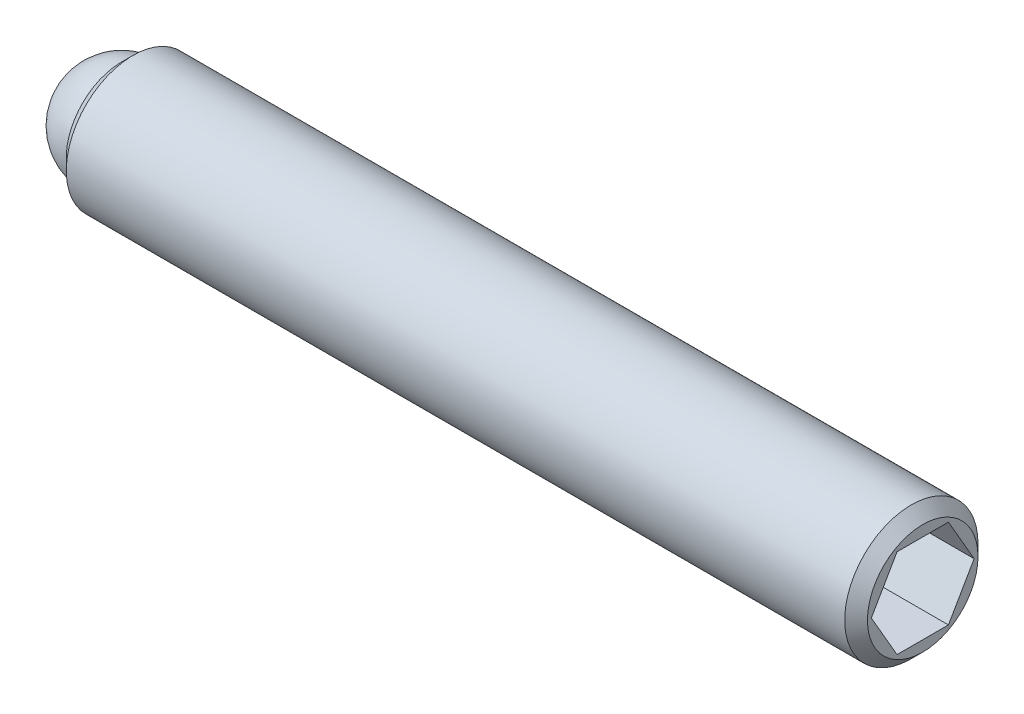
ISO-10303-21;
HEADER;
FILE_DESCRIPTION(('STEP AP214'),'2;1');
FILE_NAME('part.step','',(''),(''),'','','');
FILE_SCHEMA(('AUTOMOTIVE_DESIGN { 1 0 10303 214 1 1 1 1 }'));
ENDSEC;
DATA;
#1=APPLICATION_CONTEXT('core data for automotive mechanical design processes');
#2=APPLICATION_PROTOCOL_DEFINITION('international standard','automotive_design',2000,#1);
#3=PRODUCT_CONTEXT('',#1,'mechanical');
#4=PRODUCT('Part','Part','',(#3));
#5=PRODUCT_RELATED_PRODUCT_CATEGORY('part','',(#4));
#6=PRODUCT_DEFINITION_FORMATION('','',#4);
#7=PRODUCT_DEFINITION_CONTEXT('part definition',#1,'design');
#8=PRODUCT_DEFINITION('design','',#6,#7);
#9=PRODUCT_DEFINITION_SHAPE('','',#8);
#10=(LENGTH_UNIT() NAMED_UNIT(*) SI_UNIT(.MILLI.,.METRE.));
#11=(NAMED_UNIT(*) PLANE_ANGLE_UNIT() SI_UNIT($,.RADIAN.));
#12=(NAMED_UNIT(*) SI_UNIT($,.STERADIAN.) SOLID_ANGLE_UNIT());
#13=UNCERTAINTY_MEASURE_WITH_UNIT(LENGTH_MEASURE(1.E-05),#10,'distance_accuracy_value','');
#14=(GEOMETRIC_REPRESENTATION_CONTEXT(3) GLOBAL_UNCERTAINTY_ASSIGNED_CONTEXT((#13)) GLOBAL_UNIT_ASSIGNED_CONTEXT((#10,
#11,#12)) REPRESENTATION_CONTEXT('',''));
#15=CARTESIAN_POINT('',(0.,0.,0.));
#16=DIRECTION('',(0.,0.,1.));
#17=DIRECTION('',(1.,0.,0.));
#18=AXIS2_PLACEMENT_3D('',#15,#16,#17);
#19=CARTESIAN_POINT('',(0.,0.,0.));
#20=DIRECTION('',(0.,-1.,0.));
#21=DIRECTION('',(0.,0.,-1.));
#22=AXIS2_PLACEMENT_3D('',#19,#20,#21);
#23=SPHERICAL_SURFACE('',#22,1.190625);
#24=CARTESIAN_POINT('',(0.,-1.190625,0.));
#25=VERTEX_POINT('',#24);
#26=VERTEX_LOOP('',#25);
#27=FACE_BOUND('',#26,.T.);
#28=ADVANCED_FACE('F43',(#27),#23,.T.);
#29=CLOSED_SHELL('',(#28));
#30=MANIFOLD_SOLID_BREP('B2',#29);
#31=CARTESIAN_POINT('',(17.859375,0.,0.));
#32=DIRECTION('',(-1.,0.,0.));
#33=DIRECTION('',(0.,0.,1.));
#34=AXIS2_PLACEMENT_3D('',#31,#32,#33);
#35=CYLINDRICAL_SURFACE('',#34,1.4859);
#36=CARTESIAN_POINT('',(17.605375,0.,0.));
#37=DIRECTION('',(1.,0.,0.));
#38=DIRECTION('',(0.,0.,-1.));
#39=AXIS2_PLACEMENT_3D('',#36,#37,#38);
#40=CIRCLE('',#39,1.4859);
#41=CARTESIAN_POINT('',(17.605375,0.,-1.4859));
#42=VERTEX_POINT('',#41);
#43=EDGE_CURVE('E41',#42,#42,#40,.F.);
#44=ORIENTED_EDGE('',*,*,#43,.T.);
#45=EDGE_LOOP('',(#44));
#46=FACE_BOUND('',#45,.T.);
#47=CARTESIAN_POINT('',(0.254000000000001,0.,0.));
#48=DIRECTION('',(1.,0.,0.));
#49=DIRECTION('',(0.,0.,-1.));
#50=AXIS2_PLACEMENT_3D('',#47,#48,#49);
#51=CIRCLE('',#50,1.4859);
#52=CARTESIAN_POINT('',(0.254000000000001,0.,-1.4859));
#53=VERTEX_POINT('',#52);
#54=EDGE_CURVE('E159',#53,#53,#51,.T.);
#55=ORIENTED_EDGE('',*,*,#54,.T.);
#56=EDGE_LOOP('',(#55));
#57=FACE_BOUND('',#56,.T.);
#58=ADVANCED_FACE('F56',(#46,#57),#35,.T.);
#59=CARTESIAN_POINT('',(17.859375,0.,0.));
#60=DIRECTION('',(1.,0.,0.));
#61=DIRECTION('',(0.,0.,-1.));
#62=AXIS2_PLACEMENT_3D('',#59,#60,#61);
#63=PLANE('',#62);
#64=DIRECTION('',(0.,0.866025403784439,-0.5));
#65=VECTOR('',#64,1.);
#66=CARTESIAN_POINT('',(17.859375,-0.992187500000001,-0.572839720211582));
#67=LINE('',#66,#65);
#68=CARTESIAN_POINT('',(17.859375,-0.992187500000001,-0.572839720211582));
#69=VERTEX_POINT('',#68);
#70=CARTESIAN_POINT('',(17.859375,0.,-1.14567944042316));
#71=VERTEX_POINT('',#70);
#72=EDGE_CURVE('E71',#69,#71,#67,.T.);
#73=ORIENTED_EDGE('',*,*,#72,.F.);
#74=DIRECTION('',(0.,0.,-1.));
#75=VECTOR('',#74,1.);
#76=CARTESIAN_POINT('',(17.859375,-0.992187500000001,0.572839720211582));
#77=LINE('',#76,#75);
#78=CARTESIAN_POINT('',(17.859375,-0.992187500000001,0.572839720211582));
#79=VERTEX_POINT('',#78);
#80=EDGE_CURVE('E155',#79,#69,#77,.T.);
#81=ORIENTED_EDGE('',*,*,#80,.F.);
#82=DIRECTION('',(0.,-0.866025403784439,-0.5));
#83=VECTOR('',#82,1.);
#84=CARTESIAN_POINT('',(17.859375,0.,1.14567944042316));
#85=LINE('',#84,#83);
#86=CARTESIAN_POINT('',(17.859375,0.,1.14567944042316));
#87=VERTEX_POINT('',#86);
#88=EDGE_CURVE('E153',#87,#79,#85,.T.);
#89=ORIENTED_EDGE('',*,*,#88,.F.);
#90=DIRECTION('',(0.,-0.866025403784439,0.5));
#91=VECTOR('',#90,1.);
#92=CARTESIAN_POINT('',(17.859375,0.992187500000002,0.572839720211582));
#93=LINE('',#92,#91);
#94=CARTESIAN_POINT('',(17.859375,0.992187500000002,0.572839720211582));
#95=VERTEX_POINT('',#94);
#96=EDGE_CURVE('E119',#95,#87,#93,.T.);
#97=ORIENTED_EDGE('',*,*,#96,.F.);
#98=DIRECTION('',(0.,0.,1.));
#99=VECTOR('',#98,1.);
#100=CARTESIAN_POINT('',(17.859375,0.992187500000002,-0.572839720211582));
#101=LINE('',#100,#99);
#102=CARTESIAN_POINT('',(17.859375,0.992187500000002,-0.572839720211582));
#103=VERTEX_POINT('',#102);
#104=EDGE_CURVE('E149',#103,#95,#101,.T.);
#105=ORIENTED_EDGE('',*,*,#104,.F.);
#106=DIRECTION('',(0.,0.866025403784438,0.5));
#107=VECTOR('',#106,1.);
#108=CARTESIAN_POINT('',(17.859375,0.,-1.14567944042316));
#109=LINE('',#108,#107);
#110=EDGE_CURVE('E145',#71,#103,#109,.T.);
#111=ORIENTED_EDGE('',*,*,#110,.F.);
#112=EDGE_LOOP('',(#73,#81,#89,#97,#105,#111));
#113=FACE_BOUND('',#112,.T.);
#114=CARTESIAN_POINT('',(17.859375,0.,0.));
#115=DIRECTION('',(1.,0.,0.));
#116=DIRECTION('',(0.,0.,-1.));
#117=AXIS2_PLACEMENT_3D('',#114,#115,#116);
#118=CIRCLE('',#117,1.2319);
#119=CARTESIAN_POINT('',(17.859375,0.,-1.2319));
#120=VERTEX_POINT('',#119);
#121=EDGE_CURVE('E64',#120,#120,#118,.T.);
#122=ORIENTED_EDGE('',*,*,#121,.T.);
#123=EDGE_LOOP('',(#122));
#124=FACE_BOUND('',#123,.T.);
#125=ADVANCED_FACE('F172',(#113,#124),#63,.T.);
#126=CARTESIAN_POINT('',(0.,0.,0.));
#127=DIRECTION('',(1.,0.,0.));
#128=DIRECTION('',(0.,0.,-1.));
#129=AXIS2_PLACEMENT_3D('',#126,#127,#128);
#130=PLANE('',#129);
#131=CARTESIAN_POINT('',(0.,0.,0.));
#132=DIRECTION('',(-1.,0.,0.));
#133=DIRECTION('',(0.,0.,1.));
#134=AXIS2_PLACEMENT_3D('',#131,#132,#133);
#135=CIRCLE('',#134,1.190625);
#136=CARTESIAN_POINT('',(0.,0.,1.190625));
#137=VERTEX_POINT('',#136);
#138=EDGE_CURVE('E227',#137,#137,#135,.T.);
#139=ORIENTED_EDGE('',*,*,#138,.F.);
#140=EDGE_LOOP('',(#139));
#141=FACE_BOUND('',#140,.T.);
#142=CARTESIAN_POINT('',(0.,0.,0.));
#143=DIRECTION('',(1.,0.,0.));
#144=DIRECTION('',(0.,0.,-1.));
#145=AXIS2_PLACEMENT_3D('',#142,#143,#144);
#146=CIRCLE('',#145,1.2319);
#147=CARTESIAN_POINT('',(0.,0.,-1.2319));
#148=VERTEX_POINT('',#147);
#149=EDGE_CURVE('E167',#148,#148,#146,.F.);
#150=ORIENTED_EDGE('',*,*,#149,.T.);
#151=EDGE_LOOP('',(#150));
#152=FACE_BOUND('',#151,.T.);
#153=ADVANCED_FACE('F184',(#141,#152),#130,.F.);
#154=CARTESIAN_POINT('',(0.254000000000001,0.,0.));
#155=DIRECTION('',(1.,0.,0.));
#156=DIRECTION('',(0.,0.,-1.));
#157=AXIS2_PLACEMENT_3D('',#154,#155,#156);
#158=CONICAL_SURFACE('',#157,1.4859,0.785398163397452);
#159=ORIENTED_EDGE('',*,*,#149,.F.);
#160=EDGE_LOOP('',(#159));
#161=FACE_BOUND('',#160,.T.);
#162=ORIENTED_EDGE('',*,*,#54,.F.);
#163=EDGE_LOOP('',(#162));
#164=FACE_BOUND('',#163,.T.);
#165=ADVANCED_FACE('F176',(#161,#164),#158,.T.);
#166=CARTESIAN_POINT('',(17.859375,0.,0.));
#167=DIRECTION('',(-1.,0.,0.));
#168=DIRECTION('',(0.,0.,1.));
#169=AXIS2_PLACEMENT_3D('',#166,#167,#168);
#170=CONICAL_SURFACE('',#169,1.2319,0.785398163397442);
#171=ORIENTED_EDGE('',*,*,#43,.F.);
#172=EDGE_LOOP('',(#171));
#173=FACE_BOUND('',#172,.T.);
#174=ORIENTED_EDGE('',*,*,#121,.F.);
#175=EDGE_LOOP('',(#174));
#176=FACE_BOUND('',#175,.T.);
#177=ADVANCED_FACE('F58',(#173,#176),#170,.T.);
#178=CARTESIAN_POINT('',(15.573375,-0.992187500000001,-0.572839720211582));
#179=DIRECTION('',(0.,-0.5,-0.866025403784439));
#180=DIRECTION('',(0.,0.866025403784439,-0.5));
#181=AXIS2_PLACEMENT_3D('',#178,#179,#180);
#182=PLANE('',#181);
#183=ORIENTED_EDGE('',*,*,#72,.T.);
#184=DIRECTION('',(1.,0.,0.));
#185=VECTOR('',#184,1.);
#186=CARTESIAN_POINT('',(15.573375,0.,-1.14567944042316));
#187=LINE('',#186,#185);
#188=CARTESIAN_POINT('',(15.573375,0.,-1.14567944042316));
#189=VERTEX_POINT('',#188);
#190=EDGE_CURVE('E101',#189,#71,#187,.T.);
#191=ORIENTED_EDGE('',*,*,#190,.F.);
#192=DIRECTION('',(0.,0.866025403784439,-0.5));
#193=VECTOR('',#192,1.);
#194=CARTESIAN_POINT('',(15.573375,-0.992187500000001,-0.572839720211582));
#195=LINE('',#194,#193);
#196=CARTESIAN_POINT('',(15.573375,-0.992187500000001,-0.572839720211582));
#197=VERTEX_POINT('',#196);
#198=EDGE_CURVE('E157',#197,#189,#195,.T.);
#199=ORIENTED_EDGE('',*,*,#198,.F.);
#200=DIRECTION('',(1.,0.,0.));
#201=VECTOR('',#200,1.);
#202=CARTESIAN_POINT('',(15.573375,-0.992187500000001,-0.572839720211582));
#203=LINE('',#202,#201);
#204=EDGE_CURVE('E79',#197,#69,#203,.T.);
#205=ORIENTED_EDGE('',*,*,#204,.T.);
#206=EDGE_LOOP('',(#183,#191,#199,#205));
#207=FACE_BOUND('',#206,.T.);
#208=ADVANCED_FACE('F175',(#207),#182,.F.);
#209=CARTESIAN_POINT('',(15.573375,-0.992187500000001,0.572839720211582));
#210=DIRECTION('',(0.,-1.,0.));
#211=DIRECTION('',(0.,0.,-1.));
#212=AXIS2_PLACEMENT_3D('',#209,#210,#211);
#213=PLANE('',#212);
#214=ORIENTED_EDGE('',*,*,#80,.T.);
#215=ORIENTED_EDGE('',*,*,#204,.F.);
#216=DIRECTION('',(0.,0.,-1.));
#217=VECTOR('',#216,1.);
#218=CARTESIAN_POINT('',(15.573375,-0.992187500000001,0.572839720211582));
#219=LINE('',#218,#217);
#220=CARTESIAN_POINT('',(15.573375,-0.992187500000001,0.572839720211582));
#221=VERTEX_POINT('',#220);
#222=EDGE_CURVE('E131',#221,#197,#219,.T.);
#223=ORIENTED_EDGE('',*,*,#222,.F.);
#224=DIRECTION('',(1.,0.,0.));
#225=VECTOR('',#224,1.);
#226=CARTESIAN_POINT('',(15.573375,-0.992187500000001,0.572839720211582));
#227=LINE('',#226,#225);
#228=EDGE_CURVE('E123',#221,#79,#227,.T.);
#229=ORIENTED_EDGE('',*,*,#228,.T.);
#230=EDGE_LOOP('',(#214,#215,#223,#229));
#231=FACE_BOUND('',#230,.T.);
#232=ADVANCED_FACE('F182',(#231),#213,.F.);
#233=CARTESIAN_POINT('',(15.573375,0.,1.14567944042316));
#234=DIRECTION('',(0.,-0.5,0.866025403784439));
#235=DIRECTION('',(0.,-0.866025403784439,-0.5));
#236=AXIS2_PLACEMENT_3D('',#233,#234,#235);
#237=PLANE('',#236);
#238=ORIENTED_EDGE('',*,*,#88,.T.);
#239=ORIENTED_EDGE('',*,*,#228,.F.);
#240=DIRECTION('',(0.,-0.866025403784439,-0.5));
#241=VECTOR('',#240,1.);
#242=CARTESIAN_POINT('',(15.573375,0.,1.14567944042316));
#243=LINE('',#242,#241);
#244=CARTESIAN_POINT('',(15.573375,0.,1.14567944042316));
#245=VERTEX_POINT('',#244);
#246=EDGE_CURVE('E127',#245,#221,#243,.T.);
#247=ORIENTED_EDGE('',*,*,#246,.F.);
#248=DIRECTION('',(1.,0.,0.));
#249=VECTOR('',#248,1.);
#250=CARTESIAN_POINT('',(15.573375,0.,1.14567944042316));
#251=LINE('',#250,#249);
#252=EDGE_CURVE('E112',#245,#87,#251,.T.);
#253=ORIENTED_EDGE('',*,*,#252,.T.);
#254=EDGE_LOOP('',(#238,#239,#247,#253));
#255=FACE_BOUND('',#254,.T.);
#256=ADVANCED_FACE('F128',(#255),#237,.F.);
#257=CARTESIAN_POINT('',(15.573375,0.992187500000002,0.572839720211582));
#258=DIRECTION('',(0.,0.5,0.866025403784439));
#259=DIRECTION('',(0.,-0.866025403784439,0.5));
#260=AXIS2_PLACEMENT_3D('',#257,#258,#259);
#261=PLANE('',#260);
#262=ORIENTED_EDGE('',*,*,#96,.T.);
#263=ORIENTED_EDGE('',*,*,#252,.F.);
#264=DIRECTION('',(0.,-0.866025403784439,0.5));
#265=VECTOR('',#264,1.);
#266=CARTESIAN_POINT('',(15.573375,0.992187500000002,0.572839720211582));
#267=LINE('',#266,#265);
#268=CARTESIAN_POINT('',(15.573375,0.992187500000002,0.572839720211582));
#269=VERTEX_POINT('',#268);
#270=EDGE_CURVE('E116',#269,#245,#267,.T.);
#271=ORIENTED_EDGE('',*,*,#270,.F.);
#272=DIRECTION('',(1.,0.,0.));
#273=VECTOR('',#272,1.);
#274=CARTESIAN_POINT('',(15.573375,0.992187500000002,0.572839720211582));
#275=LINE('',#274,#273);
#276=EDGE_CURVE('E124',#269,#95,#275,.T.);
#277=ORIENTED_EDGE('',*,*,#276,.T.);
#278=EDGE_LOOP('',(#262,#263,#271,#277));
#279=FACE_BOUND('',#278,.T.);
#280=ADVANCED_FACE('F114',(#279),#261,.F.);
#281=CARTESIAN_POINT('',(15.573375,0.992187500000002,-0.572839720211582));
#282=DIRECTION('',(0.,1.,0.));
#283=DIRECTION('',(0.,0.,1.));
#284=AXIS2_PLACEMENT_3D('',#281,#282,#283);
#285=PLANE('',#284);
#286=ORIENTED_EDGE('',*,*,#104,.T.);
#287=ORIENTED_EDGE('',*,*,#276,.F.);
#288=DIRECTION('',(0.,0.,1.));
#289=VECTOR('',#288,1.);
#290=CARTESIAN_POINT('',(15.573375,0.992187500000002,-0.572839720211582));
#291=LINE('',#290,#289);
#292=CARTESIAN_POINT('',(15.573375,0.992187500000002,-0.572839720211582));
#293=VERTEX_POINT('',#292);
#294=EDGE_CURVE('E137',#293,#269,#291,.T.);
#295=ORIENTED_EDGE('',*,*,#294,.F.);
#296=DIRECTION('',(1.,0.,0.));
#297=VECTOR('',#296,1.);
#298=CARTESIAN_POINT('',(15.573375,0.992187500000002,-0.572839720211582));
#299=LINE('',#298,#297);
#300=EDGE_CURVE('E162',#293,#103,#299,.T.);
#301=ORIENTED_EDGE('',*,*,#300,.T.);
#302=EDGE_LOOP('',(#286,#287,#295,#301));
#303=FACE_BOUND('',#302,.T.);
#304=ADVANCED_FACE('F203',(#303),#285,.F.);
#305=CARTESIAN_POINT('',(15.573375,0.,-1.14567944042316));
#306=DIRECTION('',(0.,0.5,-0.866025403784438));
#307=DIRECTION('',(0.,0.866025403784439,0.5));
#308=AXIS2_PLACEMENT_3D('',#305,#306,#307);
#309=PLANE('',#308);
#310=ORIENTED_EDGE('',*,*,#110,.T.);
#311=ORIENTED_EDGE('',*,*,#300,.F.);
#312=DIRECTION('',(0.,0.866025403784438,0.5));
#313=VECTOR('',#312,1.);
#314=CARTESIAN_POINT('',(15.573375,0.,-1.14567944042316));
#315=LINE('',#314,#313);
#316=EDGE_CURVE('E139',#189,#293,#315,.T.);
#317=ORIENTED_EDGE('',*,*,#316,.F.);
#318=ORIENTED_EDGE('',*,*,#190,.T.);
#319=EDGE_LOOP('',(#310,#311,#317,#318));
#320=FACE_BOUND('',#319,.T.);
#321=ADVANCED_FACE('F200',(#320),#309,.F.);
#322=CARTESIAN_POINT('',(15.573375,0.,0.));
#323=DIRECTION('',(1.,0.,0.));
#324=DIRECTION('',(0.,0.,-1.));
#325=AXIS2_PLACEMENT_3D('',#322,#323,#324);
#326=PLANE('',#325);
#327=ORIENTED_EDGE('',*,*,#198,.T.);
#328=ORIENTED_EDGE('',*,*,#316,.T.);
#329=ORIENTED_EDGE('',*,*,#294,.T.);
#330=ORIENTED_EDGE('',*,*,#270,.T.);
#331=ORIENTED_EDGE('',*,*,#246,.T.);
#332=ORIENTED_EDGE('',*,*,#222,.T.);
#333=EDGE_LOOP('',(#327,#328,#329,#330,#331,#332));
#334=FACE_BOUND('',#333,.T.);
#335=ADVANCED_FACE('F134',(#334),#326,.T.);
#336=CARTESIAN_POINT('',(1.190625,0.,0.));
#337=DIRECTION('',(-1.,0.,0.));
#338=DIRECTION('',(0.,0.,1.));
#339=AXIS2_PLACEMENT_3D('',#336,#337,#338);
#340=CYLINDRICAL_SURFACE('',#339,1.190625);
#341=CARTESIAN_POINT('',(1.190625,0.,0.));
#342=DIRECTION('',(-1.,0.,0.));
#343=DIRECTION('',(0.,0.,1.));
#344=AXIS2_PLACEMENT_3D('',#341,#342,#343);
#345=CIRCLE('',#344,1.190625);
#346=CARTESIAN_POINT('',(1.190625,0.,1.190625));
#347=VERTEX_POINT('',#346);
#348=EDGE_CURVE('E146',#347,#347,#345,.T.);
#349=CARTESIAN_POINT('',(1.190625,0.,1.190625));
#350=CARTESIAN_POINT('',(1.17822265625,0.,1.190625));
#351=CARTESIAN_POINT('',(1.1658203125,0.,1.190625));
#352=CARTESIAN_POINT('',(1.141015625,0.,1.190625));
#353=CARTESIAN_POINT('',(1.12861328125,0.,1.190625));
#354=CARTESIAN_POINT('',(1.10380859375,0.,1.190625));
#355=CARTESIAN_POINT('',(1.09140625,0.,1.190625));
#356=CARTESIAN_POINT('',(1.0666015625,0.,1.190625));
#357=CARTESIAN_POINT('',(1.05419921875,0.,1.190625));
#358=CARTESIAN_POINT('',(1.02939453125,0.,1.190625));
#359=CARTESIAN_POINT('',(1.0169921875,0.,1.190625));
#360=CARTESIAN_POINT('',(0.9921875,0.,1.190625));
#361=CARTESIAN_POINT('',(0.97978515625,0.,1.190625));
#362=CARTESIAN_POINT('',(0.95498046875,0.,1.190625));
#363=CARTESIAN_POINT('',(0.942578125,0.,1.190625));
#364=CARTESIAN_POINT('',(0.9177734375,0.,1.190625));
#365=CARTESIAN_POINT('',(0.90537109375,0.,1.190625));
#366=CARTESIAN_POINT('',(0.88056640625,0.,1.190625));
#367=CARTESIAN_POINT('',(0.8681640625,0.,1.190625));
#368=CARTESIAN_POINT('',(0.843359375,0.,1.190625));
#369=CARTESIAN_POINT('',(0.83095703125,0.,1.190625));
#370=CARTESIAN_POINT('',(0.80615234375,0.,1.190625));
#371=CARTESIAN_POINT('',(0.79375,0.,1.190625));
#372=CARTESIAN_POINT('',(0.7689453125,0.,1.190625));
#373=CARTESIAN_POINT('',(0.75654296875,0.,1.190625));
#374=CARTESIAN_POINT('',(0.73173828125,0.,1.190625));
#375=CARTESIAN_POINT('',(0.7193359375,0.,1.190625));
#376=CARTESIAN_POINT('',(0.69453125,0.,1.190625));
#377=CARTESIAN_POINT('',(0.68212890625,0.,1.190625));
#378=CARTESIAN_POINT('',(0.65732421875,0.,1.190625));
#379=CARTESIAN_POINT('',(0.644921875,0.,1.190625));
#380=CARTESIAN_POINT('',(0.6201171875,0.,1.190625));
#381=CARTESIAN_POINT('',(0.60771484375,0.,1.190625));
#382=CARTESIAN_POINT('',(0.58291015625,0.,1.190625));
#383=CARTESIAN_POINT('',(0.5705078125,0.,1.190625));
#384=CARTESIAN_POINT('',(0.545703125,0.,1.190625));
#385=CARTESIAN_POINT('',(0.53330078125,0.,1.190625));
#386=CARTESIAN_POINT('',(0.50849609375,0.,1.190625));
#387=CARTESIAN_POINT('',(0.49609375,0.,1.190625));
#388=CARTESIAN_POINT('',(0.4712890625,0.,1.190625));
#389=CARTESIAN_POINT('',(0.45888671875,0.,1.190625));
#390=CARTESIAN_POINT('',(0.43408203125,0.,1.190625));
#391=CARTESIAN_POINT('',(0.4216796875,0.,1.190625));
#392=CARTESIAN_POINT('',(0.396875,0.,1.190625));
#393=CARTESIAN_POINT('',(0.38447265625,0.,1.190625));
#394=CARTESIAN_POINT('',(0.35966796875,0.,1.190625));
#395=CARTESIAN_POINT('',(0.347265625,0.,1.190625));
#396=CARTESIAN_POINT('',(0.3224609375,0.,1.190625));
#397=CARTESIAN_POINT('',(0.31005859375,0.,1.190625));
#398=CARTESIAN_POINT('',(0.28525390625,0.,1.190625));
#399=CARTESIAN_POINT('',(0.2728515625,0.,1.190625));
#400=CARTESIAN_POINT('',(0.248046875,0.,1.190625));
#401=CARTESIAN_POINT('',(0.23564453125,0.,1.190625));
#402=CARTESIAN_POINT('',(0.21083984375,0.,1.190625));
#403=CARTESIAN_POINT('',(0.1984375,0.,1.190625));
#404=CARTESIAN_POINT('',(0.1736328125,0.,1.190625));
#405=CARTESIAN_POINT('',(0.16123046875,0.,1.190625));
#406=CARTESIAN_POINT('',(0.13642578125,0.,1.190625));
#407=CARTESIAN_POINT('',(0.1240234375,0.,1.190625));
#408=CARTESIAN_POINT('',(0.0992187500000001,0.,1.190625));
#409=CARTESIAN_POINT('',(0.08681640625,0.,1.190625));
#410=CARTESIAN_POINT('',(0.06201171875,0.,1.190625));
#411=CARTESIAN_POINT('',(0.049609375,0.,1.190625));
#412=CARTESIAN_POINT('',(0.0248046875,0.,1.190625));
#413=CARTESIAN_POINT('',(0.01240234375,0.,1.190625));
#414=CARTESIAN_POINT('',(0.,0.,1.190625));
#415=B_SPLINE_CURVE_WITH_KNOTS('',3,(#349,#350,#351,#352,#353,#354,#355,#356,#357,#358,#359,
#360,#361,#362,#363,#364,#365,#366,#367,#368,#369,#370,#371,#372,#373,#374,#375,#376,#377,#378,
#379,#380,#381,#382,#383,#384,#385,#386,#387,#388,#389,#390,#391,#392,#393,#394,#395,#396,#397,
#398,#399,#400,#401,#402,#403,#404,#405,#406,#407,#408,#409,#410,#411,#412,#413,#414),
.UNSPECIFIED.,.F.,.F.,(4,2,2,2,2,2,2,2,2,2,2,2,2,2,2,2,2,2,2,2,2,2,2,2,2,2,2,2,2,2,2,2,4),(0.,
0.03720703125,0.0744140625,0.11162109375,0.148828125,0.18603515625,0.2232421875,0.26044921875,
0.29765625,0.33486328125,0.3720703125,0.40927734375,0.446484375,0.48369140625,0.5208984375,
0.55810546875,0.5953125,0.63251953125,0.6697265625,0.70693359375,0.744140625,0.78134765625,
0.8185546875,0.85576171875,0.89296875,0.93017578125,0.9673828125,1.00458984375,1.041796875,
1.07900390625,1.1162109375,1.15341796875,1.190625),.UNSPECIFIED.);
#416=EDGE_CURVE('BSEAM216',#347,#137,#415,.T.);
#417=ORIENTED_EDGE('',*,*,#348,.F.);
#418=ORIENTED_EDGE('',*,*,#138,.T.);
#419=ORIENTED_EDGE('',*,*,#416,.T.);
#420=ORIENTED_EDGE('',*,*,#416,.F.);
#421=EDGE_LOOP('',(#417,#419,#418,#420));
#422=FACE_BOUND('',#421,.T.);
#423=ADVANCED_FACE('F216',(#422),#340,.F.);
#424=CARTESIAN_POINT('',(1.190625,0.,0.));
#425=DIRECTION('',(-1.,0.,0.));
#426=DIRECTION('',(0.,0.,1.));
#427=AXIS2_PLACEMENT_3D('',#424,#425,#426);
#428=PLANE('',#427);
#429=ORIENTED_EDGE('',*,*,#348,.T.);
#430=EDGE_LOOP('',(#429));
#431=FACE_BOUND('',#430,.T.);
#432=ADVANCED_FACE('F219',(#431),#428,.T.);
#433=CLOSED_SHELL('',(#58,#125,#153,#165,#177,#208,#232,#256,#280,#304,#321,#335,#423,#432));
#434=MANIFOLD_SOLID_BREP('B6',#433);
#435=ADVANCED_BREP_SHAPE_REPRESENTATION('',(#18,#30,#434),#14);
#436=SHAPE_DEFINITION_REPRESENTATION(#9,#435);
ENDSEC;
END-ISO-10303-21;
